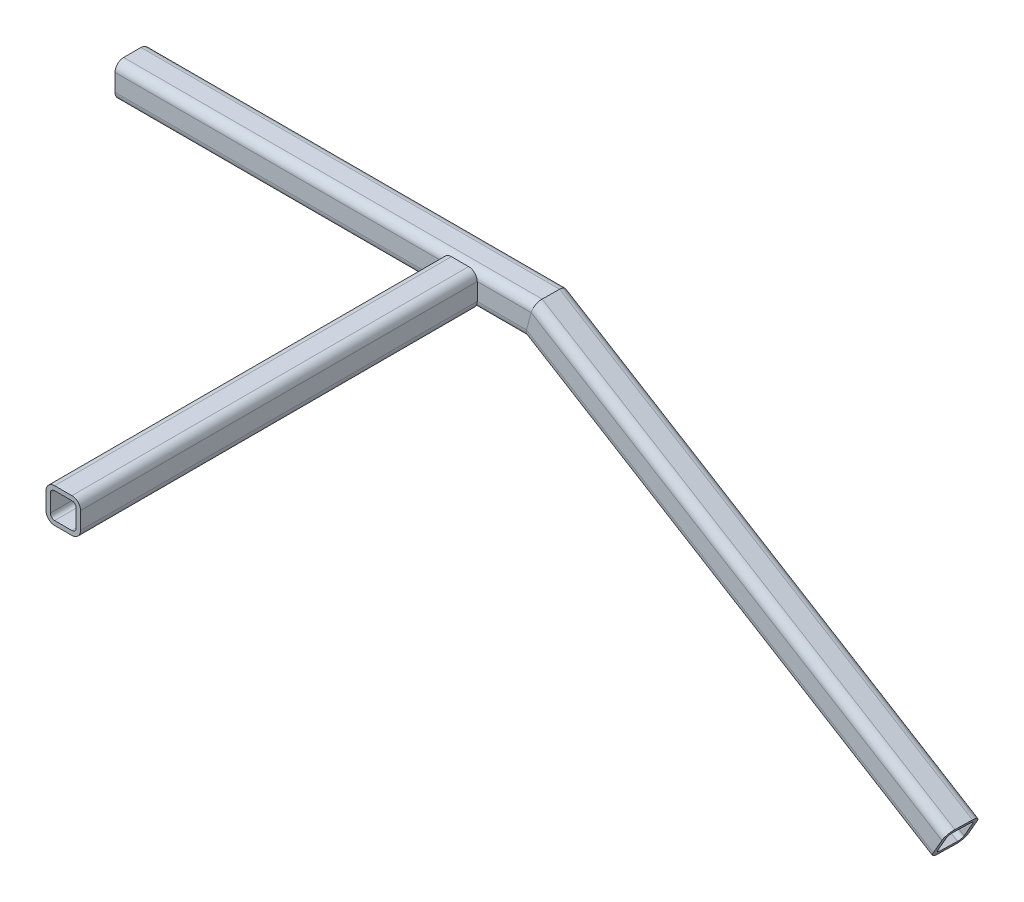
from build123d import *

# Parameters (mm, degrees)
SQUARE_TUBE_2_X_2_X_0_25_1_DEPTH   = 620.225009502
SQUARE_TUBE_2_X_2_X_0_25_1_2_DEPTH = 721.825009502
SQUARE_TUBE_2_X_2_X_0_25_1_3_DEPTH = 610.6


with BuildPart() as part:
    # Sketch12 → Square tube 2 X 2 X 0.25_1 (new body)
    with BuildSketch(Plane(origin=(0, 0, 0), x_dir=(0, 0, -1), z_dir=(1, 0, 0))):
        with BuildLine():
            Line((-12.7, -25.4), (12.7, -25.4))
            ThreePointArc((12.7, -25.4), (21.680256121, -21.680256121), (25.4, -12.7))
            Line((25.4, -12.7), (25.4, 12.7))
            ThreePointArc((25.4, 12.7), (21.680256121, 21.680256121), (12.7, 25.4))
            Line((12.7, 25.4), (-12.7, 25.4))
            ThreePointArc((-12.7, 25.4), (-21.680256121, 21.680256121), (-25.4, 12.7))
            Line((-25.4, 12.7), (-25.4, -12.7))
            ThreePointArc((-25.4, -12.7), (-21.680256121, -21.680256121), (-12.7, -25.4))
        make_face()
        with BuildLine():
            Line((-12.7, -19.05), (12.7, -19.05))
            ThreePointArc((12.7, -19.05), (17.190128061, -17.190128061), (19.05, -12.7))
            Line((19.05, -12.7), (19.05, 12.7))
            ThreePointArc((19.05, 12.7), (17.190128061, 17.190128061), (12.7, 19.05))
            Line((12.7, 19.05), (-12.7, 19.05))
            ThreePointArc((-12.7, 19.05), (-17.190128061, 17.190128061), (-19.05, 12.7))
            Line((-19.05, 12.7), (-19.05, -12.7))
            ThreePointArc((-19.05, -12.7), (-17.190128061, -17.190128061), (-12.7, -19.05))
        make_face(mode=Mode.SUBTRACT)
    extrude(amount=SQUARE_TUBE_2_X_2_X_0_25_1_DEPTH)

    # Square tube 2 X 2 X 0.25_1 mitre 1
    split(bisect_by=Plane(origin=(609.6, 0, 0), x_dir=(-0.258637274, -0.965974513, 0), z_dir=(-0.965925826, 0.258624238, -0.010039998)), keep=Keep.TOP)


with BuildPart() as body_2:
    # Sketch12 on segment 2 (on carried to segment 2) → Square tube 2 X 2 X 0.25_1 2 (new body)
    with BuildSketch(Plane(origin=(600.398471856, 5.308506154, -0.206080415), x_dir=(0.019395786, -0.005193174, -0.999798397), z_dir=(0.866025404, -0.499623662, 0.019395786))):
        with BuildLine():
            Line((-12.7, -25.4), (12.7, -25.4))
            ThreePointArc((12.7, -25.4), (21.680256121, -21.680256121), (25.4, -12.7))
            Line((25.4, -12.7), (25.4, 12.7))
            ThreePointArc((25.4, 12.7), (21.680256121, 21.680256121), (12.7, 25.4))
            Line((12.7, 25.4), (-12.7, 25.4))
            ThreePointArc((-12.7, 25.4), (-21.680256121, 21.680256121), (-25.4, 12.7))
            Line((-25.4, 12.7), (-25.4, -12.7))
            ThreePointArc((-25.4, -12.7), (-21.680256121, -21.680256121), (-12.7, -25.4))
        make_face()
        with BuildLine():
            Line((-12.7, -19.05), (12.7, -19.05))
            ThreePointArc((12.7, -19.05), (17.190128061, -17.190128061), (19.05, -12.7))
            Line((19.05, -12.7), (19.05, 12.7))
            ThreePointArc((19.05, 12.7), (17.190128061, 17.190128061), (12.7, 19.05))
            Line((12.7, 19.05), (-12.7, 19.05))
            ThreePointArc((-12.7, 19.05), (-17.190128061, 17.190128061), (-19.05, 12.7))
            Line((-19.05, 12.7), (-19.05, -12.7))
            ThreePointArc((-19.05, -12.7), (-17.190128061, -17.190128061), (-12.7, -19.05))
        make_face(mode=Mode.SUBTRACT)
    extrude(amount=SQUARE_TUBE_2_X_2_X_0_25_1_2_DEPTH)

    # Square tube 2 X 2 X 0.25_1 2 mitre 1
    split(bisect_by=Plane(origin=(609.6, 0, 0), x_dir=(0.258637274, 0.965974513, 0), z_dir=(0.965925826, -0.258624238, 0.010039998)), keep=Keep.TOP)


with BuildPart() as body_3:
    # Sketch12 on segment 3 (on carried to segment 3) → Square tube 2 X 2 X 0.25_1 3 (new body)
    with BuildSketch(Plane(origin=(508, 0, -1), x_dir=(1, 0, 0), z_dir=(0, 0, 1))):
        with BuildLine():
            Line((-12.7, -25.4), (12.7, -25.4))
            ThreePointArc((12.7, -25.4), (21.680256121, -21.680256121), (25.4, -12.7))
            Line((25.4, -12.7), (25.4, 12.7))
            ThreePointArc((25.4, 12.7), (21.680256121, 21.680256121), (12.7, 25.4))
            Line((12.7, 25.4), (-12.7, 25.4))
            ThreePointArc((-12.7, 25.4), (-21.680256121, 21.680256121), (-25.4, 12.7))
            Line((-25.4, 12.7), (-25.4, -12.7))
            ThreePointArc((-25.4, -12.7), (-21.680256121, -21.680256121), (-12.7, -25.4))
        make_face()
        with BuildLine():
            Line((-12.7, -19.05), (12.7, -19.05))
            ThreePointArc((12.7, -19.05), (17.190128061, -17.190128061), (19.05, -12.7))
            Line((19.05, -12.7), (19.05, 12.7))
            ThreePointArc((19.05, 12.7), (17.190128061, 17.190128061), (12.7, 19.05))
            Line((12.7, 19.05), (-12.7, 19.05))
            ThreePointArc((-12.7, 19.05), (-17.190128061, 17.190128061), (-19.05, 12.7))
            Line((-19.05, 12.7), (-19.05, -12.7))
            ThreePointArc((-19.05, -12.7), (-17.190128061, -17.190128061), (-12.7, -19.05))
        make_face(mode=Mode.SUBTRACT)
    extrude(amount=SQUARE_TUBE_2_X_2_X_0_25_1_3_DEPTH)

    # Square tube 2 X 2 X 0.25_1 3 mitre 1
    split(bisect_by=Plane(origin=(508, 0, 25.4), x_dir=(0, -1, 0), z_dir=(0, 0, 1)), keep=Keep.TOP)


solid = Compound([part.part, body_2.part, body_3.part])
